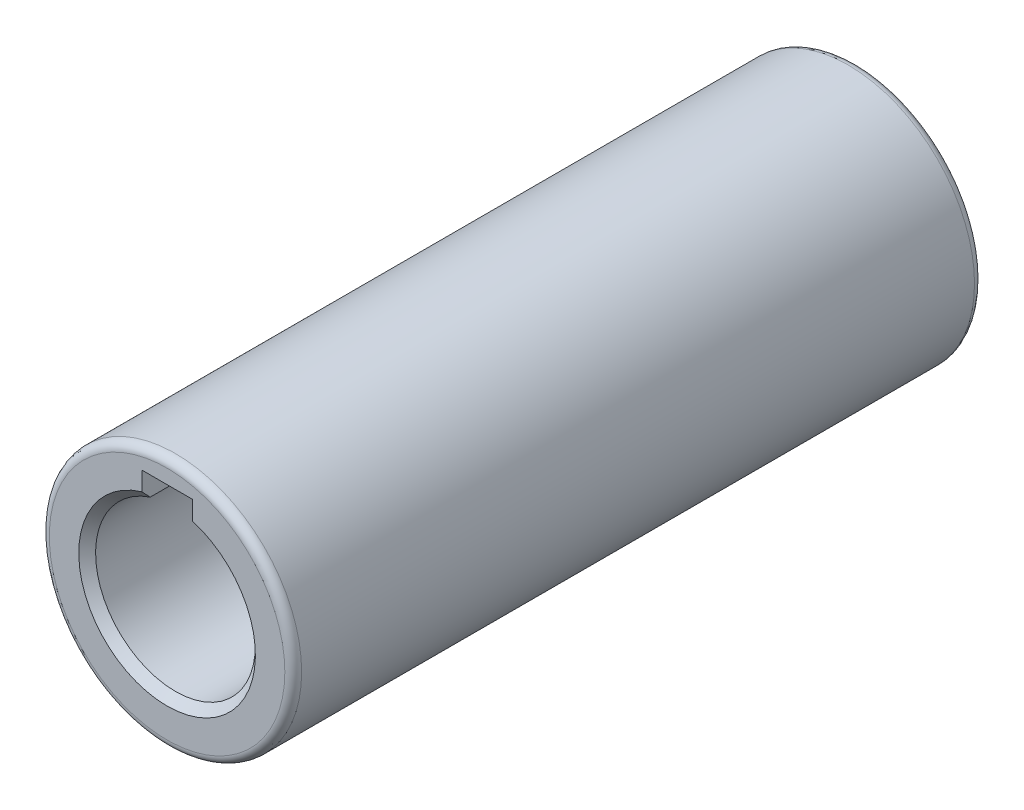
ISO-10303-21;
HEADER;
FILE_DESCRIPTION(('STEP AP214'),'2;1');
FILE_NAME('part.step','',(''),(''),'','','');
FILE_SCHEMA(('AUTOMOTIVE_DESIGN { 1 0 10303 214 1 1 1 1 }'));
ENDSEC;
DATA;
#1=APPLICATION_CONTEXT('core data for automotive mechanical design processes');
#2=APPLICATION_PROTOCOL_DEFINITION('international standard','automotive_design',2000,#1);
#3=PRODUCT_CONTEXT('',#1,'mechanical');
#4=PRODUCT('Part','Part','',(#3));
#5=PRODUCT_RELATED_PRODUCT_CATEGORY('part','',(#4));
#6=PRODUCT_DEFINITION_FORMATION('','',#4);
#7=PRODUCT_DEFINITION_CONTEXT('part definition',#1,'design');
#8=PRODUCT_DEFINITION('design','',#6,#7);
#9=PRODUCT_DEFINITION_SHAPE('','',#8);
#10=(LENGTH_UNIT() NAMED_UNIT(*) SI_UNIT(.MILLI.,.METRE.));
#11=(NAMED_UNIT(*) PLANE_ANGLE_UNIT() SI_UNIT($,.RADIAN.));
#12=(NAMED_UNIT(*) SI_UNIT($,.STERADIAN.) SOLID_ANGLE_UNIT());
#13=UNCERTAINTY_MEASURE_WITH_UNIT(LENGTH_MEASURE(1.E-05),#10,'distance_accuracy_value','');
#14=(GEOMETRIC_REPRESENTATION_CONTEXT(3) GLOBAL_UNCERTAINTY_ASSIGNED_CONTEXT((#13)) GLOBAL_UNIT_ASSIGNED_CONTEXT((#10,
#11,#12)) REPRESENTATION_CONTEXT('',''));
#15=CARTESIAN_POINT('',(0.,0.,0.));
#16=DIRECTION('',(0.,0.,1.));
#17=DIRECTION('',(1.,0.,0.));
#18=AXIS2_PLACEMENT_3D('',#15,#16,#17);
#19=CARTESIAN_POINT('',(0.,0.,-40.));
#20=DIRECTION('',(0.,0.,-1.));
#21=DIRECTION('',(0.,1.,0.));
#22=AXIS2_PLACEMENT_3D('',#19,#20,#21);
#23=CONICAL_SURFACE('',#22,9.5,0.785398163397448);
#24=CARTESIAN_POINT('',(0.,0.,-41.));
#25=DIRECTION('',(0.,0.,-1.));
#26=DIRECTION('',(0.,1.,0.));
#27=AXIS2_PLACEMENT_3D('',#24,#25,#26);
#28=CIRCLE('',#27,10.5);
#29=CARTESIAN_POINT('',(3.,10.0623058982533,-40.9999999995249));
#30=VERTEX_POINT('',#29);
#31=CARTESIAN_POINT('',(-3.,10.0623058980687,-40.999999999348));
#32=VERTEX_POINT('',#31);
#33=EDGE_CURVE('E80',#30,#32,#28,.T.);
#34=ORIENTED_EDGE('',*,*,#33,.T.);
#35=CARTESIAN_POINT('',(-3.,10.0623058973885,-40.9999999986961));
#36=CARTESIAN_POINT('',(-3.,9.88798083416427,-40.8329004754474));
#37=CARTESIAN_POINT('',(-3.,9.71344933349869,-40.6660173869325));
#38=CARTESIAN_POINT('',(-3.,9.36397343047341,-40.3326840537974));
#39=CARTESIAN_POINT('',(-3.,9.18902902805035,-40.1662338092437));
#40=CARTESIAN_POINT('',(-3.,9.0138781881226,-39.9999999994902));
#41=B_SPLINE_CURVE_WITH_KNOTS('',3,(#35,#36,#37,#38,#39,#40),.UNSPECIFIED.,.F.,.F.,(4,2,4),(0.,
0.724431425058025,1.44886296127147),.UNSPECIFIED.);
#42=CARTESIAN_POINT('',(-3.,9.01387818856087,-39.9999999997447));
#43=VERTEX_POINT('',#42);
#44=EDGE_CURVE('E94',#32,#43,#41,.T.);
#45=ORIENTED_EDGE('',*,*,#44,.T.);
#46=CARTESIAN_POINT('',(0.,0.,-40.));
#47=DIRECTION('',(0.,0.,-1.));
#48=DIRECTION('',(-1.,0.,0.));
#49=AXIS2_PLACEMENT_3D('',#46,#47,#48);
#50=CIRCLE('',#49,9.5);
#51=CARTESIAN_POINT('',(3.,9.01387818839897,-39.999999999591));
#52=VERTEX_POINT('',#51);
#53=EDGE_CURVE('E74',#52,#43,#50,.T.);
#54=ORIENTED_EDGE('',*,*,#53,.F.);
#55=CARTESIAN_POINT('',(3.00000000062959,9.01387818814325,-39.9999999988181));
#56=CARTESIAN_POINT('',(3.0000000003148,9.18902902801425,-40.1662338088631));
#57=CARTESIAN_POINT('',(3.00000000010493,9.36397343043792,-40.332684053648));
#58=CARTESIAN_POINT('',(2.99999999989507,9.7134493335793,-40.666017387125));
#59=CARTESIAN_POINT('',(2.99999999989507,9.88798083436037,-40.8329004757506));
#60=CARTESIAN_POINT('',(3.,10.0623058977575,-40.9999999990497));
#61=B_SPLINE_CURVE_WITH_KNOTS('',3,(#55,#56,#57,#58,#59,#60),.UNSPECIFIED.,.F.,.F.,(4,2,4),(0.,
0.724431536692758,1.44886296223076),.UNSPECIFIED.);
#62=EDGE_CURVE('E20',#52,#30,#61,.T.);
#63=ORIENTED_EDGE('',*,*,#62,.T.);
#64=EDGE_LOOP('',(#34,#45,#54,#63));
#65=FACE_BOUND('',#64,.T.);
#66=ADVANCED_FACE('F16',(#65),#23,.F.);
#67=CARTESIAN_POINT('',(0.,0.,40.));
#68=DIRECTION('',(0.,0.,-1.));
#69=DIRECTION('',(0.,1.,0.));
#70=AXIS2_PLACEMENT_3D('',#67,#68,#69);
#71=CYLINDRICAL_SURFACE('',#70,9.5);
#72=ORIENTED_EDGE('',*,*,#53,.T.);
#73=DIRECTION('',(0.,0.,-1.));
#74=VECTOR('',#73,1.);
#75=CARTESIAN_POINT('',(-3.,9.013878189,0.));
#76=LINE('',#75,#74);
#77=CARTESIAN_POINT('',(-3.,9.01387818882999,40.0000000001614));
#78=VERTEX_POINT('',#77);
#79=EDGE_CURVE('E116',#78,#43,#76,.T.);
#80=ORIENTED_EDGE('',*,*,#79,.F.);
#81=CARTESIAN_POINT('',(0.,0.,40.));
#82=DIRECTION('',(0.,0.,1.));
#83=DIRECTION('',(1.,0.,0.));
#84=AXIS2_PLACEMENT_3D('',#81,#82,#83);
#85=CIRCLE('',#84,9.5);
#86=CARTESIAN_POINT('',(3.,9.01387818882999,40.0000000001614));
#87=VERTEX_POINT('',#86);
#88=EDGE_CURVE('E107',#87,#78,#85,.F.);
#89=ORIENTED_EDGE('',*,*,#88,.F.);
#90=DIRECTION('',(0.,0.,1.));
#91=VECTOR('',#90,1.);
#92=CARTESIAN_POINT('',(3.,9.013878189,0.));
#93=LINE('',#92,#91);
#94=EDGE_CURVE('E101',#52,#87,#93,.T.);
#95=ORIENTED_EDGE('',*,*,#94,.F.);
#96=EDGE_LOOP('',(#72,#80,#89,#95));
#97=FACE_BOUND('',#96,.T.);
#98=ADVANCED_FACE('F192',(#97),#71,.F.);
#99=CARTESIAN_POINT('',(-14.168,-14.168,-41.));
#100=DIRECTION('',(0.,0.,1.));
#101=DIRECTION('',(1.,0.,0.));
#102=AXIS2_PLACEMENT_3D('',#99,#100,#101);
#103=PLANE('',#102);
#104=ORIENTED_EDGE('',*,*,#33,.F.);
#105=DIRECTION('',(0.,-1.,0.));
#106=VECTOR('',#105,1.);
#107=CARTESIAN_POINT('',(3.,10.6569390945,-41.));
#108=LINE('',#107,#106);
#109=CARTESIAN_POINT('',(3.,12.3,-41.));
#110=VERTEX_POINT('',#109);
#111=EDGE_CURVE('E84',#110,#30,#108,.T.);
#112=ORIENTED_EDGE('',*,*,#111,.F.);
#113=DIRECTION('',(1.,0.,0.));
#114=VECTOR('',#113,1.);
#115=CARTESIAN_POINT('',(0.,12.3,-41.));
#116=LINE('',#115,#114);
#117=CARTESIAN_POINT('',(-3.,12.3,-41.));
#118=VERTEX_POINT('',#117);
#119=EDGE_CURVE('E115',#118,#110,#116,.T.);
#120=ORIENTED_EDGE('',*,*,#119,.F.);
#121=DIRECTION('',(0.,1.,0.));
#122=VECTOR('',#121,1.);
#123=CARTESIAN_POINT('',(-3.,10.6569390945,-41.));
#124=LINE('',#123,#122);
#125=EDGE_CURVE('E86',#32,#118,#124,.T.);
#126=ORIENTED_EDGE('',*,*,#125,.F.);
#127=EDGE_LOOP('',(#104,#112,#120,#126));
#128=FACE_BOUND('',#127,.T.);
#129=CARTESIAN_POINT('',(0.,0.,-41.));
#130=DIRECTION('',(0.,0.,1.));
#131=DIRECTION('',(1.,0.,0.));
#132=AXIS2_PLACEMENT_3D('',#129,#130,#131);
#133=CIRCLE('',#132,14.);
#134=CARTESIAN_POINT('',(14.,0.,-41.));
#135=VERTEX_POINT('',#134);
#136=EDGE_CURVE('E88',#135,#135,#133,.T.);
#137=ORIENTED_EDGE('',*,*,#136,.F.);
#138=EDGE_LOOP('',(#137));
#139=FACE_BOUND('',#138,.T.);
#140=ADVANCED_FACE('F81',(#128,#139),#103,.F.);
#141=CARTESIAN_POINT('',(0.,0.,-40.));
#142=DIRECTION('',(0.,0.,1.));
#143=DIRECTION('',(1.,0.,0.));
#144=AXIS2_PLACEMENT_3D('',#141,#142,#143);
#145=TOROIDAL_SURFACE('',#144,14.,1.);
#146=CARTESIAN_POINT('',(0.,0.,-40.));
#147=DIRECTION('',(0.,0.,-1.));
#148=DIRECTION('',(-1.,0.,0.));
#149=AXIS2_PLACEMENT_3D('',#146,#147,#148);
#150=CIRCLE('',#149,15.);
#151=CARTESIAN_POINT('',(-15.,0.,-40.));
#152=VERTEX_POINT('',#151);
#153=EDGE_CURVE('E123',#152,#152,#150,.T.);
#154=ORIENTED_EDGE('',*,*,#153,.T.);
#155=EDGE_LOOP('',(#154));
#156=FACE_BOUND('',#155,.T.);
#157=ORIENTED_EDGE('',*,*,#136,.T.);
#158=EDGE_LOOP('',(#157));
#159=FACE_BOUND('',#158,.T.);
#160=ADVANCED_FACE('F202',(#156,#159),#145,.T.);
#161=CARTESIAN_POINT('',(3.,12.3,-41.));
#162=DIRECTION('',(-1.,0.,0.));
#163=DIRECTION('',(0.,-1.,0.));
#164=AXIS2_PLACEMENT_3D('',#161,#162,#163);
#165=PLANE('',#164);
#166=ORIENTED_EDGE('',*,*,#111,.T.);
#167=ORIENTED_EDGE('',*,*,#62,.F.);
#168=ORIENTED_EDGE('',*,*,#94,.T.);
#169=CARTESIAN_POINT('',(3.,10.0623058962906,40.999999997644));
#170=CARTESIAN_POINT('',(3.,9.88798083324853,40.8329004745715));
#171=CARTESIAN_POINT('',(3.,9.71344933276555,40.6660173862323));
#172=CARTESIAN_POINT('',(3.,9.36397343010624,40.332684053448));
#173=CARTESIAN_POINT('',(3.,9.18902902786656,40.1662338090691));
#174=CARTESIAN_POINT('',(3.,9.0138781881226,39.9999999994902));
#175=B_SPLINE_CURVE_WITH_KNOTS('',3,(#169,#170,#171,#172,#173,#174),.UNSPECIFIED.,.F.,.F.,(4,2,
4),(0.,0.724431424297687,1.44886295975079),.UNSPECIFIED.);
#176=CARTESIAN_POINT('',(2.999999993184,10.0623058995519,40.9999999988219));
#177=VERTEX_POINT('',#176);
#178=EDGE_CURVE('E100',#177,#87,#175,.T.);
#179=ORIENTED_EDGE('',*,*,#178,.F.);
#180=DIRECTION('',(0.,-1.,0.));
#181=VECTOR('',#180,1.);
#182=CARTESIAN_POINT('',(2.999999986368,0.,41.));
#183=LINE('',#182,#181);
#184=CARTESIAN_POINT('',(2.999999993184,12.3000000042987,41.));
#185=VERTEX_POINT('',#184);
#186=EDGE_CURVE('E127',#185,#177,#183,.T.);
#187=ORIENTED_EDGE('',*,*,#186,.F.);
#188=DIRECTION('',(0.,0.,1.));
#189=VECTOR('',#188,1.);
#190=CARTESIAN_POINT('',(3.,12.3,0.));
#191=LINE('',#190,#189);
#192=EDGE_CURVE('E97',#110,#185,#191,.T.);
#193=ORIENTED_EDGE('',*,*,#192,.F.);
#194=EDGE_LOOP('',(#166,#167,#168,#179,#187,#193));
#195=FACE_BOUND('',#194,.T.);
#196=ADVANCED_FACE('F95',(#195),#165,.T.);
#197=CARTESIAN_POINT('',(0.,0.,40.));
#198=DIRECTION('',(0.,0.,1.));
#199=DIRECTION('',(0.,-1.,0.));
#200=AXIS2_PLACEMENT_3D('',#197,#198,#199);
#201=CONICAL_SURFACE('',#200,9.5,0.785398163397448);
#202=CARTESIAN_POINT('',(-3.,10.0623058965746,40.9999999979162));
#203=CARTESIAN_POINT('',(-3.,9.887980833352,40.8329004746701));
#204=CARTESIAN_POINT('',(-3.,9.71344933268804,40.6660173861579));
#205=CARTESIAN_POINT('',(-3.,9.36397342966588,40.3326840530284));
#206=CARTESIAN_POINT('',(-3.,9.18902902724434,40.1662338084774));
#207=CARTESIAN_POINT('',(-3.,9.01387818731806,39.9999999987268));
#208=B_SPLINE_CURVE_WITH_KNOTS('',3,(#202,#203,#204,#205,#206,#207),.UNSPECIFIED.,.F.,.F.,(4,2,
4),(0.,0.724431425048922,1.44886296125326),.UNSPECIFIED.);
#209=CARTESIAN_POINT('',(-2.999999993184,10.062305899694,40.9999999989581));
#210=VERTEX_POINT('',#209);
#211=EDGE_CURVE('E122',#210,#78,#208,.T.);
#212=ORIENTED_EDGE('',*,*,#211,.F.);
#213=CARTESIAN_POINT('',(0.,0.,41.));
#214=DIRECTION('',(0.,0.,1.));
#215=DIRECTION('',(0.,-1.,0.));
#216=AXIS2_PLACEMENT_3D('',#213,#214,#215);
#217=CIRCLE('',#216,10.5);
#218=EDGE_CURVE('E133',#177,#210,#217,.F.);
#219=ORIENTED_EDGE('',*,*,#218,.F.);
#220=ORIENTED_EDGE('',*,*,#178,.T.);
#221=ORIENTED_EDGE('',*,*,#88,.T.);
#222=EDGE_LOOP('',(#212,#219,#220,#221));
#223=FACE_BOUND('',#222,.T.);
#224=ADVANCED_FACE('F186',(#223),#201,.F.);
#225=CARTESIAN_POINT('',(-3.,9.013878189,-41.));
#226=DIRECTION('',(1.,0.,0.));
#227=DIRECTION('',(0.,1.,0.));
#228=AXIS2_PLACEMENT_3D('',#225,#226,#227);
#229=PLANE('',#228);
#230=ORIENTED_EDGE('',*,*,#125,.T.);
#231=DIRECTION('',(0.,0.,-1.));
#232=VECTOR('',#231,1.);
#233=CARTESIAN_POINT('',(-3.,12.3,0.));
#234=LINE('',#233,#232);
#235=CARTESIAN_POINT('',(-2.999999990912,12.3000000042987,41.));
#236=VERTEX_POINT('',#235);
#237=EDGE_CURVE('E41',#236,#118,#234,.T.);
#238=ORIENTED_EDGE('',*,*,#237,.F.);
#239=DIRECTION('',(0.,1.,0.));
#240=VECTOR('',#239,1.);
#241=CARTESIAN_POINT('',(-2.999999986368,0.,41.));
#242=LINE('',#241,#240);
#243=EDGE_CURVE('E128',#210,#236,#242,.T.);
#244=ORIENTED_EDGE('',*,*,#243,.F.);
#245=ORIENTED_EDGE('',*,*,#211,.T.);
#246=ORIENTED_EDGE('',*,*,#79,.T.);
#247=ORIENTED_EDGE('',*,*,#44,.F.);
#248=EDGE_LOOP('',(#230,#238,#244,#245,#246,#247));
#249=FACE_BOUND('',#248,.T.);
#250=ADVANCED_FACE('F183',(#249),#229,.T.);
#251=CARTESIAN_POINT('',(-3.,12.3,41.));
#252=DIRECTION('',(0.,-1.,0.));
#253=DIRECTION('',(0.,0.,-1.));
#254=AXIS2_PLACEMENT_3D('',#251,#252,#253);
#255=PLANE('',#254);
#256=DIRECTION('',(1.,0.,0.));
#257=VECTOR('',#256,1.);
#258=CARTESIAN_POINT('',(0.,12.300000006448,41.));
#259=LINE('',#258,#257);
#260=EDGE_CURVE('E132',#236,#185,#259,.T.);
#261=ORIENTED_EDGE('',*,*,#260,.F.);
#262=ORIENTED_EDGE('',*,*,#237,.T.);
#263=ORIENTED_EDGE('',*,*,#119,.T.);
#264=ORIENTED_EDGE('',*,*,#192,.T.);
#265=EDGE_LOOP('',(#261,#262,#263,#264));
#266=FACE_BOUND('',#265,.T.);
#267=ADVANCED_FACE('F198',(#266),#255,.T.);
#268=CARTESIAN_POINT('',(0.,0.,40.));
#269=DIRECTION('',(0.,0.,-1.));
#270=DIRECTION('',(0.,1.,0.));
#271=AXIS2_PLACEMENT_3D('',#268,#269,#270);
#272=CYLINDRICAL_SURFACE('',#271,15.);
#273=ORIENTED_EDGE('',*,*,#153,.F.);
#274=EDGE_LOOP('',(#273));
#275=FACE_BOUND('',#274,.T.);
#276=CARTESIAN_POINT('',(0.,0.,40.));
#277=DIRECTION('',(0.,0.,1.));
#278=DIRECTION('',(1.,0.,0.));
#279=AXIS2_PLACEMENT_3D('',#276,#277,#278);
#280=CIRCLE('',#279,15.);
#281=CARTESIAN_POINT('',(15.,0.,40.));
#282=VERTEX_POINT('',#281);
#283=EDGE_CURVE('E32',#282,#282,#280,.T.);
#284=ORIENTED_EDGE('',*,*,#283,.F.);
#285=EDGE_LOOP('',(#284));
#286=FACE_BOUND('',#285,.T.);
#287=ADVANCED_FACE('F193',(#275,#286),#272,.T.);
#288=CARTESIAN_POINT('',(-14.168,-14.168,41.));
#289=DIRECTION('',(0.,0.,1.));
#290=DIRECTION('',(1.,0.,0.));
#291=AXIS2_PLACEMENT_3D('',#288,#289,#290);
#292=PLANE('',#291);
#293=ORIENTED_EDGE('',*,*,#243,.T.);
#294=ORIENTED_EDGE('',*,*,#260,.T.);
#295=ORIENTED_EDGE('',*,*,#186,.T.);
#296=ORIENTED_EDGE('',*,*,#218,.T.);
#297=EDGE_LOOP('',(#293,#294,#295,#296));
#298=FACE_BOUND('',#297,.T.);
#299=CARTESIAN_POINT('',(0.,0.,41.));
#300=DIRECTION('',(0.,0.,1.));
#301=DIRECTION('',(1.,0.,0.));
#302=AXIS2_PLACEMENT_3D('',#299,#300,#301);
#303=CIRCLE('',#302,14.);
#304=CARTESIAN_POINT('',(14.,0.,41.));
#305=VERTEX_POINT('',#304);
#306=EDGE_CURVE('E11',#305,#305,#303,.F.);
#307=ORIENTED_EDGE('',*,*,#306,.F.);
#308=EDGE_LOOP('',(#307));
#309=FACE_BOUND('',#308,.T.);
#310=ADVANCED_FACE('F197',(#298,#309),#292,.T.);
#311=CARTESIAN_POINT('',(0.,0.,40.));
#312=DIRECTION('',(0.,0.,1.));
#313=DIRECTION('',(1.,0.,0.));
#314=AXIS2_PLACEMENT_3D('',#311,#312,#313);
#315=TOROIDAL_SURFACE('',#314,14.,1.);
#316=ORIENTED_EDGE('',*,*,#283,.T.);
#317=EDGE_LOOP('',(#316));
#318=FACE_BOUND('',#317,.T.);
#319=ORIENTED_EDGE('',*,*,#306,.T.);
#320=EDGE_LOOP('',(#319));
#321=FACE_BOUND('',#320,.T.);
#322=ADVANCED_FACE('F18',(#318,#321),#315,.T.);
#323=CLOSED_SHELL('',(#66,#98,#140,#160,#196,#224,#250,#267,#287,#310,#322));
#324=MANIFOLD_SOLID_BREP('B1',#323);
#325=ADVANCED_BREP_SHAPE_REPRESENTATION('',(#18,#324),#14);
#326=SHAPE_DEFINITION_REPRESENTATION(#9,#325);
ENDSEC;
END-ISO-10303-21;
